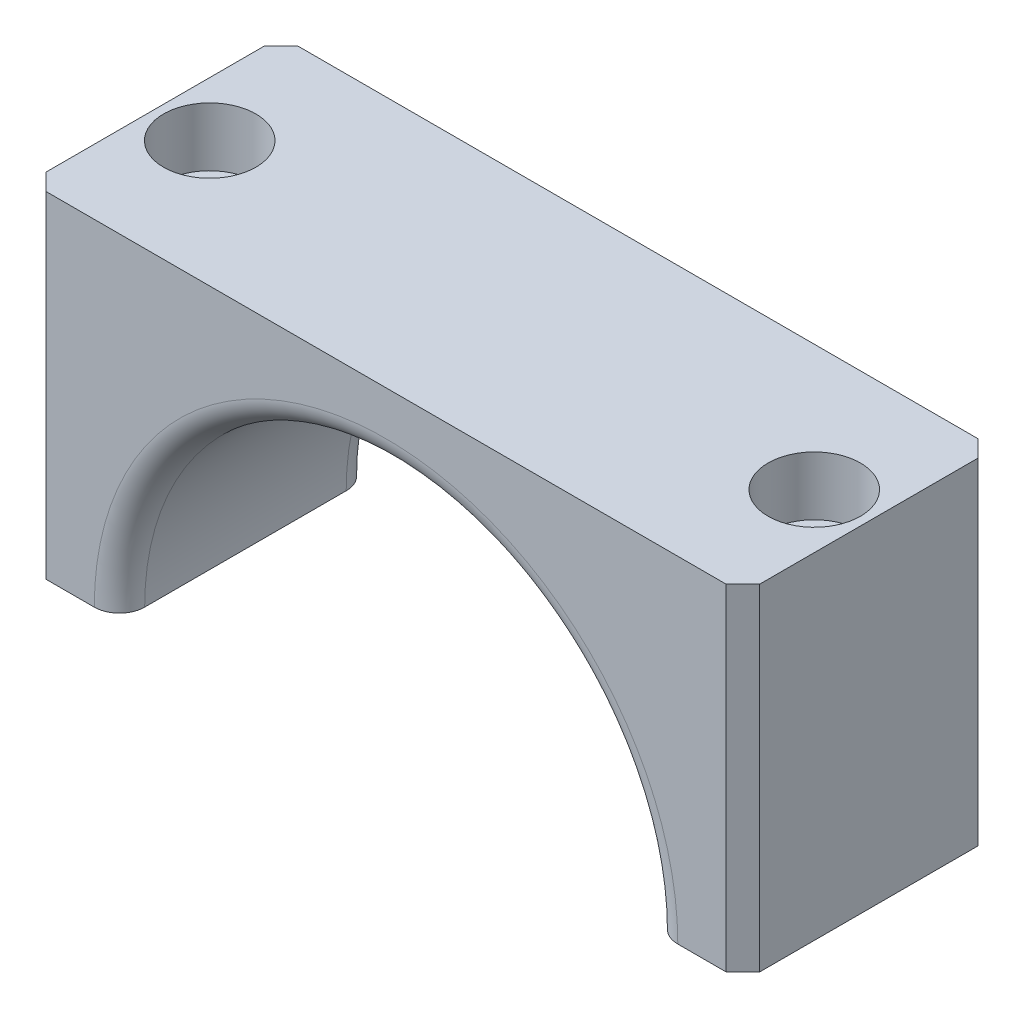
ISO-10303-21;
HEADER;
FILE_DESCRIPTION(('STEP AP214'),'2;1');
FILE_NAME('part.step','',(''),(''),'','','');
FILE_SCHEMA(('AUTOMOTIVE_DESIGN { 1 0 10303 214 1 1 1 1 }'));
ENDSEC;
DATA;
#1=APPLICATION_CONTEXT('core data for automotive mechanical design processes');
#2=APPLICATION_PROTOCOL_DEFINITION('international standard','automotive_design',2000,#1);
#3=PRODUCT_CONTEXT('',#1,'mechanical');
#4=PRODUCT('Part','Part','',(#3));
#5=PRODUCT_RELATED_PRODUCT_CATEGORY('part','',(#4));
#6=PRODUCT_DEFINITION_FORMATION('','',#4);
#7=PRODUCT_DEFINITION_CONTEXT('part definition',#1,'design');
#8=PRODUCT_DEFINITION('design','',#6,#7);
#9=PRODUCT_DEFINITION_SHAPE('','',#8);
#10=(LENGTH_UNIT() NAMED_UNIT(*) SI_UNIT(.MILLI.,.METRE.));
#11=(NAMED_UNIT(*) PLANE_ANGLE_UNIT() SI_UNIT($,.RADIAN.));
#12=(NAMED_UNIT(*) SI_UNIT($,.STERADIAN.) SOLID_ANGLE_UNIT());
#13=UNCERTAINTY_MEASURE_WITH_UNIT(LENGTH_MEASURE(1.E-05),#10,'distance_accuracy_value','');
#14=(GEOMETRIC_REPRESENTATION_CONTEXT(3) GLOBAL_UNCERTAINTY_ASSIGNED_CONTEXT((#13)) GLOBAL_UNIT_ASSIGNED_CONTEXT((#10,
#11,#12)) REPRESENTATION_CONTEXT('',''));
#15=CARTESIAN_POINT('',(0.,0.,0.));
#16=DIRECTION('',(0.,0.,1.));
#17=DIRECTION('',(1.,0.,0.));
#18=AXIS2_PLACEMENT_3D('',#15,#16,#17);
#19=CARTESIAN_POINT('',(-42.5,40.,30.));
#20=DIRECTION('',(1.,0.,0.));
#21=DIRECTION('',(0.,0.,-1.));
#22=AXIS2_PLACEMENT_3D('',#19,#20,#21);
#23=PLANE('',#22);
#24=DIRECTION('',(0.,0.,-1.));
#25=VECTOR('',#24,1.);
#26=CARTESIAN_POINT('',(-42.5,40.,30.));
#27=LINE('',#26,#25);
#28=CARTESIAN_POINT('',(-42.5,40.,28.));
#29=VERTEX_POINT('',#28);
#30=CARTESIAN_POINT('',(-42.5,40.,2.));
#31=VERTEX_POINT('',#30);
#32=EDGE_CURVE('E180',#29,#31,#27,.T.);
#33=ORIENTED_EDGE('',*,*,#32,.T.);
#34=DIRECTION('',(0.,-1.,0.));
#35=VECTOR('',#34,1.);
#36=CARTESIAN_POINT('',(-42.5,40.,2.));
#37=LINE('',#36,#35);
#38=CARTESIAN_POINT('',(-42.5,0.,2.));
#39=VERTEX_POINT('',#38);
#40=EDGE_CURVE('E175',#31,#39,#37,.T.);
#41=ORIENTED_EDGE('',*,*,#40,.T.);
#42=DIRECTION('',(0.,0.,-1.));
#43=VECTOR('',#42,1.);
#44=CARTESIAN_POINT('',(-42.5,0.,30.));
#45=LINE('',#44,#43);
#46=CARTESIAN_POINT('',(-42.5,0.,28.));
#47=VERTEX_POINT('',#46);
#48=EDGE_CURVE('E131',#47,#39,#45,.T.);
#49=ORIENTED_EDGE('',*,*,#48,.F.);
#50=DIRECTION('',(0.,1.,0.));
#51=VECTOR('',#50,1.);
#52=CARTESIAN_POINT('',(-42.5,40.,28.));
#53=LINE('',#52,#51);
#54=EDGE_CURVE('E173',#47,#29,#53,.T.);
#55=ORIENTED_EDGE('',*,*,#54,.T.);
#56=EDGE_LOOP('',(#33,#41,#49,#55));
#57=FACE_BOUND('',#56,.T.);
#58=ADVANCED_FACE('F15',(#57),#23,.F.);
#59=CARTESIAN_POINT('',(-42.5,0.,30.));
#60=DIRECTION('',(0.,1.,0.));
#61=DIRECTION('',(0.,0.,1.));
#62=AXIS2_PLACEMENT_3D('',#59,#60,#61);
#63=PLANE('',#62);
#64=CARTESIAN_POINT('',(-36.,0.,15.));
#65=DIRECTION('',(0.,1.,0.));
#66=DIRECTION('',(0.,0.,1.));
#67=AXIS2_PLACEMENT_3D('',#64,#65,#66);
#68=CIRCLE('',#67,3.3);
#69=CARTESIAN_POINT('',(-36.,0.,18.3));
#70=VERTEX_POINT('',#69);
#71=EDGE_CURVE('E245',#70,#70,#68,.T.);
#72=ORIENTED_EDGE('',*,*,#71,.T.);
#73=EDGE_LOOP('',(#72));
#74=FACE_BOUND('',#73,.T.);
#75=ORIENTED_EDGE('',*,*,#48,.T.);
#76=DIRECTION('',(-0.707106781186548,0.,0.707106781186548));
#77=VECTOR('',#76,1.);
#78=CARTESIAN_POINT('',(-42.5,0.,2.));
#79=LINE('',#78,#77);
#80=CARTESIAN_POINT('',(-40.5,0.,0.));
#81=VERTEX_POINT('',#80);
#82=EDGE_CURVE('E10',#39,#81,#79,.F.);
#83=ORIENTED_EDGE('',*,*,#82,.T.);
#84=DIRECTION('',(1.,0.,0.));
#85=VECTOR('',#84,1.);
#86=CARTESIAN_POINT('',(-42.5,0.,0.));
#87=LINE('',#86,#85);
#88=CARTESIAN_POINT('',(-34.75,0.,0.));
#89=VERTEX_POINT('',#88);
#90=EDGE_CURVE('E184',#81,#89,#87,.T.);
#91=ORIENTED_EDGE('',*,*,#90,.T.);
#92=CARTESIAN_POINT('',(-34.75,0.,3.));
#93=DIRECTION('',(0.,1.,0.));
#94=DIRECTION('',(0.,0.,1.));
#95=AXIS2_PLACEMENT_3D('',#92,#93,#94);
#96=CIRCLE('',#95,3.);
#97=CARTESIAN_POINT('',(-31.75,0.,3.));
#98=VERTEX_POINT('',#97);
#99=EDGE_CURVE('E142',#89,#98,#96,.F.);
#100=ORIENTED_EDGE('',*,*,#99,.T.);
#101=DIRECTION('',(0.,0.,-1.));
#102=VECTOR('',#101,1.);
#103=CARTESIAN_POINT('',(-31.75,0.,30.));
#104=LINE('',#103,#102);
#105=CARTESIAN_POINT('',(-31.75,0.,27.));
#106=VERTEX_POINT('',#105);
#107=EDGE_CURVE('E124',#106,#98,#104,.T.);
#108=ORIENTED_EDGE('',*,*,#107,.F.);
#109=CARTESIAN_POINT('',(-34.75,0.,27.));
#110=DIRECTION('',(0.,1.,0.));
#111=DIRECTION('',(0.,0.,1.));
#112=AXIS2_PLACEMENT_3D('',#109,#110,#111);
#113=CIRCLE('',#112,3.);
#114=CARTESIAN_POINT('',(-34.75,0.,30.));
#115=VERTEX_POINT('',#114);
#116=EDGE_CURVE('E130',#106,#115,#113,.F.);
#117=ORIENTED_EDGE('',*,*,#116,.T.);
#118=DIRECTION('',(1.,0.,0.));
#119=VECTOR('',#118,1.);
#120=CARTESIAN_POINT('',(-42.5,0.,30.));
#121=LINE('',#120,#119);
#122=CARTESIAN_POINT('',(-40.5,0.,30.));
#123=VERTEX_POINT('',#122);
#124=EDGE_CURVE('E202',#123,#115,#121,.T.);
#125=ORIENTED_EDGE('',*,*,#124,.F.);
#126=DIRECTION('',(-0.707106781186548,0.,-0.707106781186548));
#127=VECTOR('',#126,1.);
#128=CARTESIAN_POINT('',(-40.5,0.,30.));
#129=LINE('',#128,#127);
#130=EDGE_CURVE('E23',#123,#47,#129,.T.);
#131=ORIENTED_EDGE('',*,*,#130,.T.);
#132=EDGE_LOOP('',(#75,#83,#91,#100,#108,#117,#125,#131));
#133=FACE_BOUND('',#132,.T.);
#134=ADVANCED_FACE('F182',(#74,#133),#63,.F.);
#135=CARTESIAN_POINT('',(0.,0.,30.));
#136=DIRECTION('',(0.,0.,-1.));
#137=DIRECTION('',(-1.,0.,0.));
#138=AXIS2_PLACEMENT_3D('',#135,#136,#137);
#139=CYLINDRICAL_SURFACE('',#138,31.75);
#140=ORIENTED_EDGE('',*,*,#107,.T.);
#141=CARTESIAN_POINT('',(0.,0.,3.));
#142=DIRECTION('',(0.,0.,1.));
#143=DIRECTION('',(1.,0.,0.));
#144=AXIS2_PLACEMENT_3D('',#141,#142,#143);
#145=CIRCLE('',#144,31.75);
#146=CARTESIAN_POINT('',(31.75,0.,3.));
#147=VERTEX_POINT('',#146);
#148=EDGE_CURVE('E115',#98,#147,#145,.F.);
#149=ORIENTED_EDGE('',*,*,#148,.T.);
#150=DIRECTION('',(0.,0.,-1.));
#151=VECTOR('',#150,1.);
#152=CARTESIAN_POINT('',(31.75,0.,30.));
#153=LINE('',#152,#151);
#154=CARTESIAN_POINT('',(31.75,0.,27.));
#155=VERTEX_POINT('',#154);
#156=EDGE_CURVE('E107',#155,#147,#153,.T.);
#157=ORIENTED_EDGE('',*,*,#156,.F.);
#158=CARTESIAN_POINT('',(0.,0.,27.));
#159=DIRECTION('',(0.,0.,1.));
#160=DIRECTION('',(1.,0.,0.));
#161=AXIS2_PLACEMENT_3D('',#158,#159,#160);
#162=CIRCLE('',#161,31.75);
#163=EDGE_CURVE('E121',#155,#106,#162,.T.);
#164=ORIENTED_EDGE('',*,*,#163,.T.);
#165=EDGE_LOOP('',(#140,#149,#157,#164));
#166=FACE_BOUND('',#165,.T.);
#167=ADVANCED_FACE('F120',(#166),#139,.F.);
#168=CARTESIAN_POINT('',(31.75,0.,30.));
#169=DIRECTION('',(0.,1.,0.));
#170=DIRECTION('',(0.,0.,1.));
#171=AXIS2_PLACEMENT_3D('',#168,#169,#170);
#172=PLANE('',#171);
#173=CARTESIAN_POINT('',(36.,0.,15.));
#174=DIRECTION('',(0.,1.,0.));
#175=DIRECTION('',(0.,0.,1.));
#176=AXIS2_PLACEMENT_3D('',#173,#174,#175);
#177=CIRCLE('',#176,3.3);
#178=CARTESIAN_POINT('',(36.,0.,18.3));
#179=VERTEX_POINT('',#178);
#180=EDGE_CURVE('E193',#179,#179,#177,.T.);
#181=ORIENTED_EDGE('',*,*,#180,.T.);
#182=EDGE_LOOP('',(#181));
#183=FACE_BOUND('',#182,.T.);
#184=DIRECTION('',(1.,0.,0.));
#185=VECTOR('',#184,1.);
#186=CARTESIAN_POINT('',(31.75,0.,0.));
#187=LINE('',#186,#185);
#188=CARTESIAN_POINT('',(34.75,0.,0.));
#189=VERTEX_POINT('',#188);
#190=CARTESIAN_POINT('',(40.5,0.,0.));
#191=VERTEX_POINT('',#190);
#192=EDGE_CURVE('E192',#189,#191,#187,.T.);
#193=ORIENTED_EDGE('',*,*,#192,.T.);
#194=DIRECTION('',(-0.707106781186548,0.,-0.707106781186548));
#195=VECTOR('',#194,1.);
#196=CARTESIAN_POINT('',(42.5,0.,2.));
#197=LINE('',#196,#195);
#198=CARTESIAN_POINT('',(42.5,0.,2.));
#199=VERTEX_POINT('',#198);
#200=EDGE_CURVE('E165',#191,#199,#197,.F.);
#201=ORIENTED_EDGE('',*,*,#200,.T.);
#202=DIRECTION('',(0.,0.,-1.));
#203=VECTOR('',#202,1.);
#204=CARTESIAN_POINT('',(42.5,0.,30.));
#205=LINE('',#204,#203);
#206=CARTESIAN_POINT('',(42.5,0.,28.));
#207=VERTEX_POINT('',#206);
#208=EDGE_CURVE('E125',#207,#199,#205,.T.);
#209=ORIENTED_EDGE('',*,*,#208,.F.);
#210=DIRECTION('',(-0.707106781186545,0.,0.70710678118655));
#211=VECTOR('',#210,1.);
#212=CARTESIAN_POINT('',(40.5,0.,30.));
#213=LINE('',#212,#211);
#214=CARTESIAN_POINT('',(40.5,0.,30.));
#215=VERTEX_POINT('',#214);
#216=EDGE_CURVE('E163',#207,#215,#213,.T.);
#217=ORIENTED_EDGE('',*,*,#216,.T.);
#218=DIRECTION('',(1.,0.,0.));
#219=VECTOR('',#218,1.);
#220=CARTESIAN_POINT('',(31.75,0.,30.));
#221=LINE('',#220,#219);
#222=CARTESIAN_POINT('',(34.75,0.,30.));
#223=VERTEX_POINT('',#222);
#224=EDGE_CURVE('E109',#223,#215,#221,.T.);
#225=ORIENTED_EDGE('',*,*,#224,.F.);
#226=CARTESIAN_POINT('',(34.75,0.,27.));
#227=DIRECTION('',(0.,1.,0.));
#228=DIRECTION('',(0.,0.,1.));
#229=AXIS2_PLACEMENT_3D('',#226,#227,#228);
#230=CIRCLE('',#229,3.);
#231=EDGE_CURVE('E103',#223,#155,#230,.F.);
#232=ORIENTED_EDGE('',*,*,#231,.T.);
#233=ORIENTED_EDGE('',*,*,#156,.T.);
#234=CARTESIAN_POINT('',(34.75,0.,3.));
#235=DIRECTION('',(0.,1.,0.));
#236=DIRECTION('',(0.,0.,1.));
#237=AXIS2_PLACEMENT_3D('',#234,#235,#236);
#238=CIRCLE('',#237,3.);
#239=EDGE_CURVE('E114',#147,#189,#238,.F.);
#240=ORIENTED_EDGE('',*,*,#239,.T.);
#241=EDGE_LOOP('',(#193,#201,#209,#217,#225,#232,#233,#240));
#242=FACE_BOUND('',#241,.T.);
#243=ADVANCED_FACE('F106',(#183,#242),#172,.F.);
#244=CARTESIAN_POINT('',(42.5,40.,30.));
#245=DIRECTION('',(-1.,0.,0.));
#246=DIRECTION('',(0.,-1.,0.));
#247=AXIS2_PLACEMENT_3D('',#244,#245,#246);
#248=PLANE('',#247);
#249=ORIENTED_EDGE('',*,*,#208,.T.);
#250=DIRECTION('',(0.,1.,0.));
#251=VECTOR('',#250,1.);
#252=CARTESIAN_POINT('',(42.5,40.,2.));
#253=LINE('',#252,#251);
#254=CARTESIAN_POINT('',(42.5,40.,2.));
#255=VERTEX_POINT('',#254);
#256=EDGE_CURVE('E148',#199,#255,#253,.T.);
#257=ORIENTED_EDGE('',*,*,#256,.T.);
#258=DIRECTION('',(0.,0.,-1.));
#259=VECTOR('',#258,1.);
#260=CARTESIAN_POINT('',(42.5,40.,30.));
#261=LINE('',#260,#259);
#262=CARTESIAN_POINT('',(42.5,40.,28.));
#263=VERTEX_POINT('',#262);
#264=EDGE_CURVE('E208',#263,#255,#261,.T.);
#265=ORIENTED_EDGE('',*,*,#264,.F.);
#266=DIRECTION('',(0.,-1.,0.));
#267=VECTOR('',#266,1.);
#268=CARTESIAN_POINT('',(42.5,0.,28.));
#269=LINE('',#268,#267);
#270=EDGE_CURVE('E146',#263,#207,#269,.T.);
#271=ORIENTED_EDGE('',*,*,#270,.T.);
#272=EDGE_LOOP('',(#249,#257,#265,#271));
#273=FACE_BOUND('',#272,.T.);
#274=ADVANCED_FACE('F221',(#273),#248,.F.);
#275=CARTESIAN_POINT('',(-42.5,40.,30.));
#276=DIRECTION('',(0.,-1.,0.));
#277=DIRECTION('',(0.,0.,-1.));
#278=AXIS2_PLACEMENT_3D('',#275,#276,#277);
#279=PLANE('',#278);
#280=CARTESIAN_POINT('',(-36.,40.,15.));
#281=DIRECTION('',(0.,1.,0.));
#282=DIRECTION('',(0.,0.,1.));
#283=AXIS2_PLACEMENT_3D('',#280,#281,#282);
#284=CIRCLE('',#283,5.5);
#285=CARTESIAN_POINT('',(-36.,40.,20.5));
#286=VERTEX_POINT('',#285);
#287=EDGE_CURVE('E254',#286,#286,#284,.T.);
#288=ORIENTED_EDGE('',*,*,#287,.F.);
#289=EDGE_LOOP('',(#288));
#290=FACE_BOUND('',#289,.T.);
#291=CARTESIAN_POINT('',(36.,40.,15.));
#292=DIRECTION('',(0.,1.,0.));
#293=DIRECTION('',(0.,0.,1.));
#294=AXIS2_PLACEMENT_3D('',#291,#292,#293);
#295=CIRCLE('',#294,5.5);
#296=CARTESIAN_POINT('',(36.,40.,20.5));
#297=VERTEX_POINT('',#296);
#298=EDGE_CURVE('E242',#297,#297,#295,.T.);
#299=ORIENTED_EDGE('',*,*,#298,.F.);
#300=EDGE_LOOP('',(#299));
#301=FACE_BOUND('',#300,.T.);
#302=ORIENTED_EDGE('',*,*,#264,.T.);
#303=DIRECTION('',(0.707106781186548,0.,0.707106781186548));
#304=VECTOR('',#303,1.);
#305=CARTESIAN_POINT('',(42.5,40.,2.));
#306=LINE('',#305,#304);
#307=CARTESIAN_POINT('',(40.5,40.,0.));
#308=VERTEX_POINT('',#307);
#309=EDGE_CURVE('E157',#255,#308,#306,.F.);
#310=ORIENTED_EDGE('',*,*,#309,.T.);
#311=DIRECTION('',(-1.,0.,0.));
#312=VECTOR('',#311,1.);
#313=CARTESIAN_POINT('',(-42.5,40.,0.));
#314=LINE('',#313,#312);
#315=CARTESIAN_POINT('',(-40.5,40.,0.));
#316=VERTEX_POINT('',#315);
#317=EDGE_CURVE('E200',#308,#316,#314,.T.);
#318=ORIENTED_EDGE('',*,*,#317,.T.);
#319=DIRECTION('',(0.707106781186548,0.,-0.707106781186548));
#320=VECTOR('',#319,1.);
#321=CARTESIAN_POINT('',(-42.5,40.,2.));
#322=LINE('',#321,#320);
#323=EDGE_CURVE('E153',#316,#31,#322,.F.);
#324=ORIENTED_EDGE('',*,*,#323,.T.);
#325=ORIENTED_EDGE('',*,*,#32,.F.);
#326=DIRECTION('',(0.707106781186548,0.,0.707106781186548));
#327=VECTOR('',#326,1.);
#328=CARTESIAN_POINT('',(-40.5,40.,30.));
#329=LINE('',#328,#327);
#330=CARTESIAN_POINT('',(-40.5,40.,30.));
#331=VERTEX_POINT('',#330);
#332=EDGE_CURVE('E151',#29,#331,#329,.T.);
#333=ORIENTED_EDGE('',*,*,#332,.T.);
#334=DIRECTION('',(-1.,0.,0.));
#335=VECTOR('',#334,1.);
#336=CARTESIAN_POINT('',(-42.5,40.,30.));
#337=LINE('',#336,#335);
#338=CARTESIAN_POINT('',(40.5,40.,30.));
#339=VERTEX_POINT('',#338);
#340=EDGE_CURVE('E209',#339,#331,#337,.T.);
#341=ORIENTED_EDGE('',*,*,#340,.F.);
#342=DIRECTION('',(0.707106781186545,0.,-0.70710678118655));
#343=VECTOR('',#342,1.);
#344=CARTESIAN_POINT('',(40.5,40.,30.));
#345=LINE('',#344,#343);
#346=EDGE_CURVE('E155',#339,#263,#345,.T.);
#347=ORIENTED_EDGE('',*,*,#346,.T.);
#348=EDGE_LOOP('',(#302,#310,#318,#324,#325,#333,#341,#347));
#349=FACE_BOUND('',#348,.T.);
#350=ADVANCED_FACE('F198',(#290,#301,#349),#279,.F.);
#351=CARTESIAN_POINT('',(0.,0.,30.));
#352=DIRECTION('',(0.,0.,1.));
#353=DIRECTION('',(1.,0.,0.));
#354=AXIS2_PLACEMENT_3D('',#351,#352,#353);
#355=PLANE('',#354);
#356=ORIENTED_EDGE('',*,*,#224,.T.);
#357=DIRECTION('',(0.,1.,0.));
#358=VECTOR('',#357,1.);
#359=CARTESIAN_POINT('',(40.5,40.,30.));
#360=LINE('',#359,#358);
#361=EDGE_CURVE('E170',#215,#339,#360,.T.);
#362=ORIENTED_EDGE('',*,*,#361,.T.);
#363=ORIENTED_EDGE('',*,*,#340,.T.);
#364=DIRECTION('',(0.,-1.,0.));
#365=VECTOR('',#364,1.);
#366=CARTESIAN_POINT('',(-40.5,0.,30.));
#367=LINE('',#366,#365);
#368=EDGE_CURVE('E167',#331,#123,#367,.T.);
#369=ORIENTED_EDGE('',*,*,#368,.T.);
#370=ORIENTED_EDGE('',*,*,#124,.T.);
#371=CARTESIAN_POINT('',(0.,0.,30.));
#372=DIRECTION('',(0.,0.,1.));
#373=DIRECTION('',(1.,0.,0.));
#374=AXIS2_PLACEMENT_3D('',#371,#372,#373);
#375=CIRCLE('',#374,34.75);
#376=EDGE_CURVE('E144',#115,#223,#375,.F.);
#377=ORIENTED_EDGE('',*,*,#376,.T.);
#378=EDGE_LOOP('',(#356,#362,#363,#369,#370,#377));
#379=FACE_BOUND('',#378,.T.);
#380=ADVANCED_FACE('F228',(#379),#355,.T.);
#381=CARTESIAN_POINT('',(0.,0.,0.));
#382=DIRECTION('',(0.,0.,1.));
#383=DIRECTION('',(1.,0.,0.));
#384=AXIS2_PLACEMENT_3D('',#381,#382,#383);
#385=PLANE('',#384);
#386=ORIENTED_EDGE('',*,*,#317,.F.);
#387=DIRECTION('',(0.,-1.,0.));
#388=VECTOR('',#387,1.);
#389=CARTESIAN_POINT('',(40.5,0.,0.));
#390=LINE('',#389,#388);
#391=EDGE_CURVE('E161',#308,#191,#390,.T.);
#392=ORIENTED_EDGE('',*,*,#391,.T.);
#393=ORIENTED_EDGE('',*,*,#192,.F.);
#394=CARTESIAN_POINT('',(0.,0.,0.));
#395=DIRECTION('',(0.,0.,1.));
#396=DIRECTION('',(1.,0.,0.));
#397=AXIS2_PLACEMENT_3D('',#394,#395,#396);
#398=CIRCLE('',#397,34.75);
#399=EDGE_CURVE('E138',#189,#89,#398,.T.);
#400=ORIENTED_EDGE('',*,*,#399,.T.);
#401=ORIENTED_EDGE('',*,*,#90,.F.);
#402=DIRECTION('',(0.,1.,0.));
#403=VECTOR('',#402,1.);
#404=CARTESIAN_POINT('',(-40.5,0.,0.));
#405=LINE('',#404,#403);
#406=EDGE_CURVE('E159',#81,#316,#405,.T.);
#407=ORIENTED_EDGE('',*,*,#406,.T.);
#408=EDGE_LOOP('',(#386,#392,#393,#400,#401,#407));
#409=FACE_BOUND('',#408,.T.);
#410=ADVANCED_FACE('F187',(#409),#385,.F.);
#411=CARTESIAN_POINT('',(36.,40.,15.));
#412=DIRECTION('',(0.,1.,0.));
#413=DIRECTION('',(0.,0.,1.));
#414=AXIS2_PLACEMENT_3D('',#411,#412,#413);
#415=CYLINDRICAL_SURFACE('',#414,3.3);
#416=ORIENTED_EDGE('',*,*,#180,.F.);
#417=EDGE_LOOP('',(#416));
#418=FACE_BOUND('',#417,.T.);
#419=CARTESIAN_POINT('',(36.,33.,15.));
#420=DIRECTION('',(0.,1.,0.));
#421=DIRECTION('',(0.,0.,1.));
#422=AXIS2_PLACEMENT_3D('',#419,#420,#421);
#423=CIRCLE('',#422,3.3);
#424=CARTESIAN_POINT('',(36.,33.,18.3));
#425=VERTEX_POINT('',#424);
#426=EDGE_CURVE('E236',#425,#425,#423,.T.);
#427=ORIENTED_EDGE('',*,*,#426,.T.);
#428=EDGE_LOOP('',(#427));
#429=FACE_BOUND('',#428,.T.);
#430=ADVANCED_FACE('F280',(#418,#429),#415,.F.);
#431=CARTESIAN_POINT('',(39.3,33.,15.));
#432=DIRECTION('',(0.,-1.,0.));
#433=DIRECTION('',(0.,0.,-1.));
#434=AXIS2_PLACEMENT_3D('',#431,#432,#433);
#435=PLANE('',#434);
#436=ORIENTED_EDGE('',*,*,#426,.F.);
#437=EDGE_LOOP('',(#436));
#438=FACE_BOUND('',#437,.T.);
#439=CARTESIAN_POINT('',(36.,33.,15.));
#440=DIRECTION('',(0.,1.,0.));
#441=DIRECTION('',(0.,0.,1.));
#442=AXIS2_PLACEMENT_3D('',#439,#440,#441);
#443=CIRCLE('',#442,5.5);
#444=CARTESIAN_POINT('',(36.,33.,20.5));
#445=VERTEX_POINT('',#444);
#446=EDGE_CURVE('E239',#445,#445,#443,.T.);
#447=ORIENTED_EDGE('',*,*,#446,.T.);
#448=EDGE_LOOP('',(#447));
#449=FACE_BOUND('',#448,.T.);
#450=ADVANCED_FACE('F268',(#438,#449),#435,.F.);
#451=CARTESIAN_POINT('',(36.,40.,15.));
#452=DIRECTION('',(0.,1.,0.));
#453=DIRECTION('',(0.,0.,1.));
#454=AXIS2_PLACEMENT_3D('',#451,#452,#453);
#455=CYLINDRICAL_SURFACE('',#454,5.5);
#456=ORIENTED_EDGE('',*,*,#446,.F.);
#457=EDGE_LOOP('',(#456));
#458=FACE_BOUND('',#457,.T.);
#459=ORIENTED_EDGE('',*,*,#298,.T.);
#460=EDGE_LOOP('',(#459));
#461=FACE_BOUND('',#460,.T.);
#462=ADVANCED_FACE('F265',(#458,#461),#455,.F.);
#463=CARTESIAN_POINT('',(-36.,40.,15.));
#464=DIRECTION('',(0.,1.,0.));
#465=DIRECTION('',(0.,0.,1.));
#466=AXIS2_PLACEMENT_3D('',#463,#464,#465);
#467=CYLINDRICAL_SURFACE('',#466,3.3);
#468=ORIENTED_EDGE('',*,*,#71,.F.);
#469=EDGE_LOOP('',(#468));
#470=FACE_BOUND('',#469,.T.);
#471=CARTESIAN_POINT('',(-36.,33.,15.));
#472=DIRECTION('',(0.,1.,0.));
#473=DIRECTION('',(0.,0.,1.));
#474=AXIS2_PLACEMENT_3D('',#471,#472,#473);
#475=CIRCLE('',#474,3.3);
#476=CARTESIAN_POINT('',(-36.,33.,18.3));
#477=VERTEX_POINT('',#476);
#478=EDGE_CURVE('E248',#477,#477,#475,.T.);
#479=ORIENTED_EDGE('',*,*,#478,.T.);
#480=EDGE_LOOP('',(#479));
#481=FACE_BOUND('',#480,.T.);
#482=ADVANCED_FACE('F267',(#470,#481),#467,.F.);
#483=CARTESIAN_POINT('',(-32.7,33.,15.));
#484=DIRECTION('',(0.,-1.,0.));
#485=DIRECTION('',(0.,0.,-1.));
#486=AXIS2_PLACEMENT_3D('',#483,#484,#485);
#487=PLANE('',#486);
#488=ORIENTED_EDGE('',*,*,#478,.F.);
#489=EDGE_LOOP('',(#488));
#490=FACE_BOUND('',#489,.T.);
#491=CARTESIAN_POINT('',(-36.,33.,15.));
#492=DIRECTION('',(0.,1.,0.));
#493=DIRECTION('',(0.,0.,1.));
#494=AXIS2_PLACEMENT_3D('',#491,#492,#493);
#495=CIRCLE('',#494,5.5);
#496=CARTESIAN_POINT('',(-36.,33.,20.5));
#497=VERTEX_POINT('',#496);
#498=EDGE_CURVE('E251',#497,#497,#495,.T.);
#499=ORIENTED_EDGE('',*,*,#498,.T.);
#500=EDGE_LOOP('',(#499));
#501=FACE_BOUND('',#500,.T.);
#502=ADVANCED_FACE('F277',(#490,#501),#487,.F.);
#503=CARTESIAN_POINT('',(-36.,40.,15.));
#504=DIRECTION('',(0.,1.,0.));
#505=DIRECTION('',(0.,0.,1.));
#506=AXIS2_PLACEMENT_3D('',#503,#504,#505);
#507=CYLINDRICAL_SURFACE('',#506,5.5);
#508=ORIENTED_EDGE('',*,*,#498,.F.);
#509=EDGE_LOOP('',(#508));
#510=FACE_BOUND('',#509,.T.);
#511=ORIENTED_EDGE('',*,*,#287,.T.);
#512=EDGE_LOOP('',(#511));
#513=FACE_BOUND('',#512,.T.);
#514=ADVANCED_FACE('F258',(#510,#513),#507,.F.);
#515=CARTESIAN_POINT('',(0.,0.,3.));
#516=DIRECTION('',(0.,0.,1.));
#517=DIRECTION('',(1.,0.,0.));
#518=AXIS2_PLACEMENT_3D('',#515,#516,#517);
#519=TOROIDAL_SURFACE('',#518,34.75,3.);
#520=ORIENTED_EDGE('',*,*,#99,.F.);
#521=ORIENTED_EDGE('',*,*,#399,.F.);
#522=ORIENTED_EDGE('',*,*,#239,.F.);
#523=ORIENTED_EDGE('',*,*,#148,.F.);
#524=EDGE_LOOP('',(#520,#521,#522,#523));
#525=FACE_BOUND('',#524,.T.);
#526=ADVANCED_FACE('F213',(#525),#519,.T.);
#527=CARTESIAN_POINT('',(0.,0.,27.));
#528=DIRECTION('',(0.,0.,1.));
#529=DIRECTION('',(1.,0.,0.));
#530=AXIS2_PLACEMENT_3D('',#527,#528,#529);
#531=TOROIDAL_SURFACE('',#530,34.75,3.);
#532=ORIENTED_EDGE('',*,*,#116,.F.);
#533=ORIENTED_EDGE('',*,*,#163,.F.);
#534=ORIENTED_EDGE('',*,*,#231,.F.);
#535=ORIENTED_EDGE('',*,*,#376,.F.);
#536=EDGE_LOOP('',(#532,#533,#534,#535));
#537=FACE_BOUND('',#536,.T.);
#538=ADVANCED_FACE('F128',(#537),#531,.T.);
#539=CARTESIAN_POINT('',(42.5,40.,2.));
#540=DIRECTION('',(-0.707106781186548,0.,0.707106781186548));
#541=DIRECTION('',(0.707106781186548,0.,0.707106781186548));
#542=AXIS2_PLACEMENT_3D('',#539,#540,#541);
#543=PLANE('',#542);
#544=ORIENTED_EDGE('',*,*,#200,.F.);
#545=ORIENTED_EDGE('',*,*,#391,.F.);
#546=ORIENTED_EDGE('',*,*,#309,.F.);
#547=ORIENTED_EDGE('',*,*,#256,.F.);
#548=EDGE_LOOP('',(#544,#545,#546,#547));
#549=FACE_BOUND('',#548,.T.);
#550=ADVANCED_FACE('F216',(#549),#543,.F.);
#551=CARTESIAN_POINT('',(40.5,0.,30.));
#552=DIRECTION('',(0.70710678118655,0.,0.707106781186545));
#553=DIRECTION('',(0.707106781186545,0.,-0.70710678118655));
#554=AXIS2_PLACEMENT_3D('',#551,#552,#553);
#555=PLANE('',#554);
#556=ORIENTED_EDGE('',*,*,#216,.F.);
#557=ORIENTED_EDGE('',*,*,#270,.F.);
#558=ORIENTED_EDGE('',*,*,#346,.F.);
#559=ORIENTED_EDGE('',*,*,#361,.F.);
#560=EDGE_LOOP('',(#556,#557,#558,#559));
#561=FACE_BOUND('',#560,.T.);
#562=ADVANCED_FACE('F225',(#561),#555,.T.);
#563=CARTESIAN_POINT('',(-42.5,40.,2.));
#564=DIRECTION('',(0.707106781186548,0.,0.707106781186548));
#565=DIRECTION('',(0.707106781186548,0.,-0.707106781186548));
#566=AXIS2_PLACEMENT_3D('',#563,#564,#565);
#567=PLANE('',#566);
#568=ORIENTED_EDGE('',*,*,#323,.F.);
#569=ORIENTED_EDGE('',*,*,#406,.F.);
#570=ORIENTED_EDGE('',*,*,#82,.F.);
#571=ORIENTED_EDGE('',*,*,#40,.F.);
#572=EDGE_LOOP('',(#568,#569,#570,#571));
#573=FACE_BOUND('',#572,.T.);
#574=ADVANCED_FACE('F195',(#573),#567,.F.);
#575=CARTESIAN_POINT('',(-40.5,0.,30.));
#576=DIRECTION('',(-0.707106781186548,0.,0.707106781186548));
#577=DIRECTION('',(0.707106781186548,0.,0.707106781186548));
#578=AXIS2_PLACEMENT_3D('',#575,#576,#577);
#579=PLANE('',#578);
#580=ORIENTED_EDGE('',*,*,#332,.F.);
#581=ORIENTED_EDGE('',*,*,#54,.F.);
#582=ORIENTED_EDGE('',*,*,#130,.F.);
#583=ORIENTED_EDGE('',*,*,#368,.F.);
#584=EDGE_LOOP('',(#580,#581,#582,#583));
#585=FACE_BOUND('',#584,.T.);
#586=ADVANCED_FACE('F17',(#585),#579,.T.);
#587=CLOSED_SHELL('',(#58,#134,#167,#243,#274,#350,#380,#410,#430,#450,#462,#482,#502,#514,#526,
#538,#550,#562,#574,#586));
#588=MANIFOLD_SOLID_BREP('B1',#587);
#589=ADVANCED_BREP_SHAPE_REPRESENTATION('',(#18,#588),#14);
#590=SHAPE_DEFINITION_REPRESENTATION(#9,#589);
ENDSEC;
END-ISO-10303-21;
